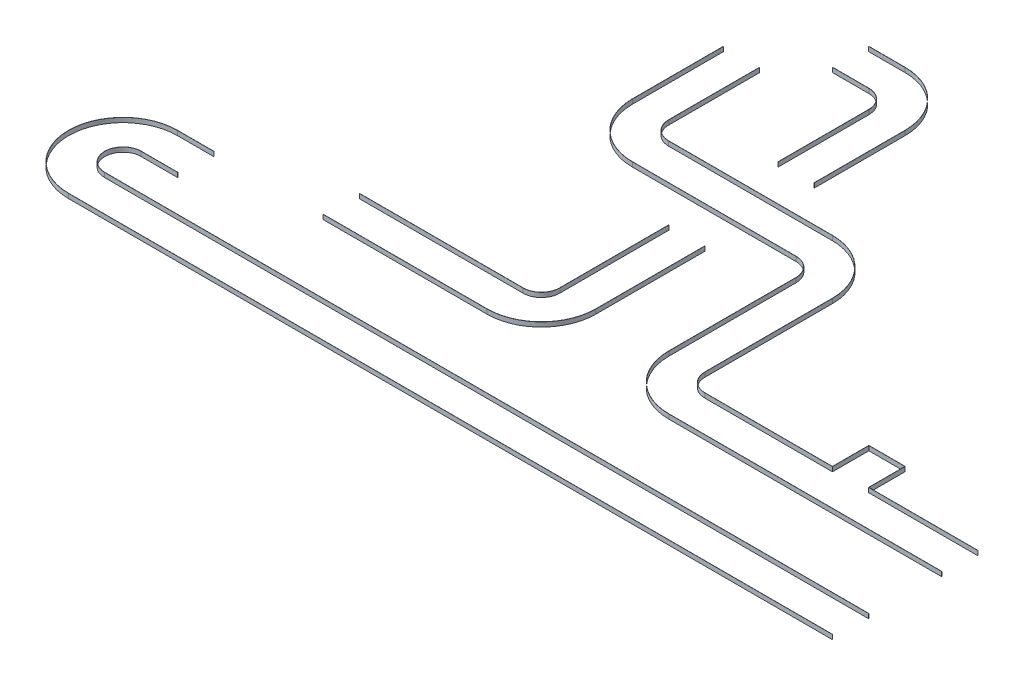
from build123d import *

# Parameters (mm, degrees)
BOSS_EXTRUDE1_DEPTH   = 76.2
BOSS_EXTRUDE1_2_DEPTH = 76.2
SKETCH3_W             = 1828.8
SKETCH3_H             = 1219.2
SKETCH3_W_2           = 1219.2
CUT_EXTRUDE1_DEPTH    = 76.2
SHELL1_T              = -2.54
SHELL2_T              = -2.54
SHELL3_T              = -2.54
SHELL4_T              = -2.54
SKETCH4_W             = 2.54
SKETCH4_H             = 604.52
SKETCH4_W_2           = 604.52
SKETCH4_H_2           = 2.54
CUT_EXTRUDE3_DEPTH    = 76.2


with BuildPart() as part:
    # Sketch1 → Boss-Extrude1 (new body)
    with BuildSketch(Plane(origin=(0, 0, 0), x_dir=(1, 0, 0), z_dir=(0, 1, 0))):
        with BuildLine():
            Line((0, 0), (-12801.6, 0))
            ThreePointArc((-12801.6, 0), (-13716, 914.4), (-12801.6, 1828.8))
            Line((-12801.6, 1828.8), (-12192, 1828.8))
            Line((-12192, 1828.8), (-12192, 2438.4))
            Line((-12192, 2438.4), (-7620, 2438.4))
            ThreePointArc((-7620, 2438.4), (-7404.473853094, 2527.673853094), (-7315.2, 2743.2))
            Line((-7315.2, 2743.2), (-7315.2, 4572))
            Line((-7315.2, 4572), (-6705.6, 4572))
            Line((-6705.6, 4572), (-6705.6, 2743.2))
            ThreePointArc((-6705.6, 2743.2), (-6973.421559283, 2096.621559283), (-7620, 1828.8))
            Line((-7620, 1828.8), (-10363.2, 1828.8))
            Line((-10363.2, 1828.8), (-10363.2, 1219.2))
            Line((-10363.2, 1219.2), (-12192, 1219.2))
            Line((-12192, 1219.2), (-12801.6, 1219.2))
            ThreePointArc((-12801.6, 1219.2), (-13106.4, 914.4), (-12801.6, 609.6))
            Line((-12801.6, 609.6), (0, 609.6))
            Line((0, 609.6), (0, 0))
        make_face()
    extrude(amount=BOSS_EXTRUDE1_DEPTH)


with BuildPart() as body_2:
    # Sketch1 → Boss-Extrude1 2 (new body)
    with BuildSketch(Plane(origin=(0, 0, 0), x_dir=(1, 0, 0), z_dir=(0, 1, 0))):
        with BuildLine():
            Line((0, 1828.8), (0, 2438.4))
            Line((0, 2438.4), (-1828.8, 2438.4))
            Line((-1828.8, 2438.4), (-1828.8, 3048))
            Line((-1828.8, 3048), (-2438.4, 3048))
            Line((-2438.4, 3048), (-2438.4, 2438.4))
            Line((-2438.4, 2438.4), (-4572, 2438.4))
            ThreePointArc((-4572, 2438.4), (-4787.526146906, 2527.673853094), (-4876.8, 2743.2))
            Line((-4876.8, 2743.2), (-4876.8, 4876.8))
            ThreePointArc((-4876.8, 4876.8), (-5144.621559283, 5523.378440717), (-5791.2, 5791.2))
            Line((-5791.2, 5791.2), (-8534.4, 5791.2))
            ThreePointArc((-8534.4, 5791.2), (-8749.926146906, 5880.473853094), (-8839.2, 6096))
            Line((-8839.2, 6096), (-8839.2, 7620))
            Line((-8839.2, 7620), (-8229.6, 7620))
            Line((-8229.6, 7620), (-8229.6, 8229.6))
            Line((-8229.6, 8229.6), (-7620, 8229.6))
            ThreePointArc((-7620, 8229.6), (-7404.473853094, 8140.326146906), (-7315.2, 7924.8))
            Line((-7315.2, 7924.8), (-7315.2, 6400.8))
            Line((-7315.2, 6400.8), (-6705.6, 6400.8))
            Line((-6705.6, 6400.8), (-6705.6, 7924.8))
            ThreePointArc((-6705.6, 7924.8), (-6973.421559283, 8571.378440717), (-7620, 8839.2))
            Line((-7620, 8839.2), (-8229.6, 8839.2))
            Line((-8229.6, 8839.2), (-9448.8, 8839.2))
            Line((-9448.8, 8839.2), (-9448.8, 7620))
            Line((-9448.8, 7620), (-9448.8, 6096))
            ThreePointArc((-9448.8, 6096), (-9180.978440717, 5449.421559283), (-8534.4, 5181.6))
            Line((-8534.4, 5181.6), (-5791.2, 5181.6))
            ThreePointArc((-5791.2, 5181.6), (-5575.673853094, 5092.326146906), (-5486.4, 4876.8))
            Line((-5486.4, 4876.8), (-5486.4, 2743.2))
            ThreePointArc((-5486.4, 2743.2), (-5218.578440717, 2096.621559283), (-4572, 1828.8))
            Line((-4572, 1828.8), (0, 1828.8))
        make_face()
    extrude(amount=BOSS_EXTRUDE1_2_DEPTH)


with BuildPart() as cut_extrude1_tool:
    # Sketch3 → Cut-Extrude1 (new body)
    with BuildSketch(Plane(origin=(0, 76.2, 0), x_dir=(1, 0, 0), z_dir=(0, 1, 0))):
        with Locations((-11277.6, 1828.8)):
            Rectangle(SKETCH3_W, SKETCH3_H)
        with Locations((-8839.2, 8229.6)):
            Rectangle(SKETCH3_W_2, SKETCH3_H)
    extrude(amount=-CUT_EXTRUDE1_DEPTH)


with BuildPart() as part_1:
    add(part.part)

    # Cut-Extrude1: cut by cut_extrude1_tool
    add(cut_extrude1_tool.part, mode=Mode.SUBTRACT)


with BuildPart() as body_2_1:
    add(body_2.part)

    # Cut-Extrude1: cut by cut_extrude1_tool
    add(cut_extrude1_tool.part, mode=Mode.SUBTRACT)


with BuildPart() as cut_extrude1_piece_1:
    # of the separate pieces the step leaves, piece 1, a body of its own (cut_extrude1_pieces)
    add(part_1.part.solids().sort_by_distance((-12801.6, 0, -1828.8))[0])

    # Shell1
    shell1_openings = [cut_extrude1_piece_1.faces().sort_by_distance(p)[0] for p in [
        (-7495.619514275, 76.2, -429.466520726),
        (-7495.619514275, 0, -429.466520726),
    ]]
    offset(amount=SHELL1_T, openings=shell1_openings, kind=Kind.INTERSECTION)


with BuildPart() as cut_extrude1_piece_2:
    # of the separate pieces the step leaves, piece 2, a body of its own (cut_extrude1_pieces)
    add(part_1.part.solids().sort_by_distance((-10363.2, 0, -2438.4))[0])

    # Shell2
    shell2_openings = [cut_extrude1_piece_2.faces().sort_by_distance(p)[0] for p in [
        (-10317.48, 76.2, -2133.6),
        (-10317.48, 0, -2133.6),
    ]]
    offset(amount=SHELL2_T, openings=shell2_openings, kind=Kind.INTERSECTION)


with BuildPart() as cut_extrude1_piece_1_of_body_2:
    # of the separate pieces the step leaves, piece 1, a body of its own (cut_extrude1_pieces_of_body_2)
    add(body_2_1.part.solids().sort_by_distance((-4572, 0, -1828.8))[0])

    # Shell3
    shell3_openings = [cut_extrude1_piece_1_of_body_2.faces().sort_by_distance(p)[0] for p in [
        (-5180.898506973, 76.2, -3997.852873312),
        (-5180.898506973, 0, -3997.852873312),
    ]]
    offset(amount=SHELL3_T, openings=shell3_openings, kind=Kind.INTERSECTION)


with BuildPart() as cut_extrude1_piece_2_of_body_2:
    # of the separate pieces the step leaves, piece 2, a body of its own (cut_extrude1_pieces_of_body_2)
    add(body_2_1.part.solids().sort_by_distance((-7620, 0, -8839.2))[0])

    # Shell4
    shell4_openings = [cut_extrude1_piece_2_of_body_2.faces().sort_by_distance(p)[0] for p in [
        (-7249.328437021, 76.2, -7799.573120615),
        (-7249.328437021, 0, -7799.573120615),
    ]]
    offset(amount=SHELL4_T, openings=shell4_openings, kind=Kind.INTERSECTION)


with BuildPart() as cut_extrude3_tool:
    # Sketch4 → Cut-Extrude3 (new body)
    with BuildSketch(Plane(origin=(0, 76.2, 0), x_dir=(1, 0, 0), z_dir=(0, 1, 0))):
        with Locations((-1.27, 304.8)):
            Rectangle(SKETCH4_W, SKETCH4_H)
        with Locations((-1.27, 2133.6)):
            Rectangle(SKETCH4_W, SKETCH4_H)
        with Locations((-12193.27, 1524)):
            Rectangle(SKETCH4_W, SKETCH4_H)
        with Locations((-10361.93, 2133.6)):
            Rectangle(SKETCH4_W, SKETCH4_H)
        with Locations((-7010.4, 4570.73)):
            Rectangle(SKETCH4_W_2, SKETCH4_H_2)
        with Locations((-9144, 7618.73)):
            Rectangle(SKETCH4_W_2, SKETCH4_H_2)
        with Locations((-7010.4, 6402.07)):
            Rectangle(SKETCH4_W_2, SKETCH4_H_2)
        with Locations((-8228.33, 8534.4)):
            Rectangle(SKETCH4_W, SKETCH4_H)
    extrude(amount=-CUT_EXTRUDE3_DEPTH)


with BuildPart() as cut_extrude1_piece_1_1:
    add(cut_extrude1_piece_1.part)

    # Cut-Extrude3: cut by cut_extrude3_tool
    add(cut_extrude3_tool.part, mode=Mode.SUBTRACT)


with BuildPart() as cut_extrude1_piece_2_1:
    add(cut_extrude1_piece_2.part)

    # Cut-Extrude3: cut by cut_extrude3_tool
    add(cut_extrude3_tool.part, mode=Mode.SUBTRACT)


with BuildPart() as cut_extrude1_piece_1_of_body_2_1:
    add(cut_extrude1_piece_1_of_body_2.part)

    # Cut-Extrude3: cut by cut_extrude3_tool
    add(cut_extrude3_tool.part, mode=Mode.SUBTRACT)


with BuildPart() as cut_extrude1_piece_2_of_body_2_1:
    add(cut_extrude1_piece_2_of_body_2.part)

    # Cut-Extrude3: cut by cut_extrude3_tool
    add(cut_extrude3_tool.part, mode=Mode.SUBTRACT)


with BuildPart() as cut_extrude3_piece_1:
    # of the separate pieces the step leaves, piece 1, a body of its own (cut_extrude3_pieces)
    add(cut_extrude1_piece_1_1.part.solids().sort_by_distance((-12801.6, 0, -1828.8))[0])


with BuildPart() as cut_extrude3_piece_2:
    # of the separate pieces the step leaves, piece 2, a body of its own (cut_extrude3_pieces)
    add(cut_extrude1_piece_1_1.part.solids().sort_by_distance((-12192, 76.2, -1219.2))[0])


with BuildPart() as cut_extrude3_piece_1_of_cut_extrude1_pie:
    # of the separate pieces the step leaves, piece 1, a body of its own (cut_extrude3_pieces_of_cut_extrude1_piec)
    add(cut_extrude1_piece_2_1.part.solids().sort_by_distance((-10363.2, 0, -1831.34))[0])


with BuildPart() as cut_extrude3_piece_2_of_cut_extrude1_pie:
    # of the separate pieces the step leaves, piece 2, a body of its own (cut_extrude3_pieces_of_cut_extrude1_piec)
    add(cut_extrude1_piece_2_1.part.solids().sort_by_distance((-10363.2, 0, -2438.4))[0])


with BuildPart() as cut_extrude3_piece_1_of_cut_extrude1_2:
    # of the separate pieces the step leaves, piece 1, a body of its own (cut_extrude3_pieces_of_cut_extrude1_2)
    add(cut_extrude1_piece_1_of_body_2_1.part.solids().sort_by_distance((0, 0, -2435.86))[0])


with BuildPart() as cut_extrude3_piece_2_of_cut_extrude1_2:
    # of the separate pieces the step leaves, piece 2, a body of its own (cut_extrude3_pieces_of_cut_extrude1_2)
    add(cut_extrude1_piece_1_of_body_2_1.part.solids().sort_by_distance((-4572, 0, -1828.8))[0])


with BuildPart() as cut_extrude3_piece_1_of_cut_extrude1_3:
    # of the separate pieces the step leaves, piece 1, a body of its own (cut_extrude3_pieces_of_cut_extrude1_3)
    add(cut_extrude1_piece_2_of_body_2_1.part.solids().sort_by_distance((-7620, 0, -8839.2))[0])


with BuildPart() as cut_extrude3_piece_2_of_cut_extrude1_3:
    # of the separate pieces the step leaves, piece 2, a body of its own (cut_extrude3_pieces_of_cut_extrude1_3)
    add(cut_extrude1_piece_2_of_body_2_1.part.solids().sort_by_distance((-8229.6, 0, -8232.14))[0])


solid = Compound([cut_extrude3_piece_1.part, cut_extrude3_piece_2.part, cut_extrude3_piece_1_of_cut_extrude1_pie.part, cut_extrude3_piece_2_of_cut_extrude1_pie.part, cut_extrude3_piece_1_of_cut_extrude1_2.part, cut_extrude3_piece_2_of_cut_extrude1_2.part, cut_extrude3_piece_1_of_cut_extrude1_3.part, cut_extrude3_piece_2_of_cut_extrude1_3.part])
